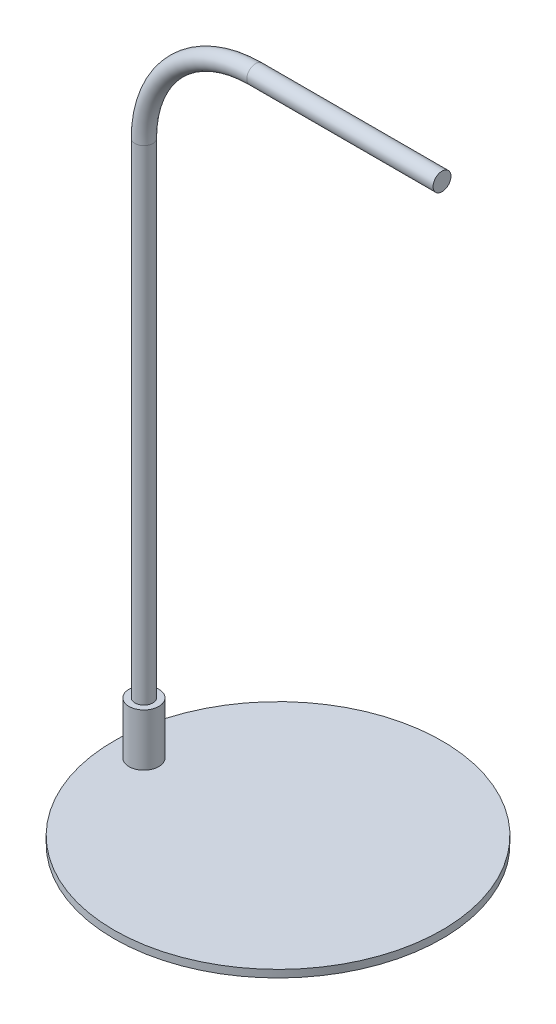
ISO-10303-21;
HEADER;
FILE_DESCRIPTION(('STEP AP214'),'2;1');
FILE_NAME('part.step','',(''),(''),'','','');
FILE_SCHEMA(('AUTOMOTIVE_DESIGN { 1 0 10303 214 1 1 1 1 }'));
ENDSEC;
DATA;
#1=APPLICATION_CONTEXT('core data for automotive mechanical design processes');
#2=APPLICATION_PROTOCOL_DEFINITION('international standard','automotive_design',2000,#1);
#3=PRODUCT_CONTEXT('',#1,'mechanical');
#4=PRODUCT('Part','Part','',(#3));
#5=PRODUCT_RELATED_PRODUCT_CATEGORY('part','',(#4));
#6=PRODUCT_DEFINITION_FORMATION('','',#4);
#7=PRODUCT_DEFINITION_CONTEXT('part definition',#1,'design');
#8=PRODUCT_DEFINITION('design','',#6,#7);
#9=PRODUCT_DEFINITION_SHAPE('','',#8);
#10=(LENGTH_UNIT() NAMED_UNIT(*) SI_UNIT(.MILLI.,.METRE.));
#11=(NAMED_UNIT(*) PLANE_ANGLE_UNIT() SI_UNIT($,.RADIAN.));
#12=(NAMED_UNIT(*) SI_UNIT($,.STERADIAN.) SOLID_ANGLE_UNIT());
#13=UNCERTAINTY_MEASURE_WITH_UNIT(LENGTH_MEASURE(1.E-05),#10,'distance_accuracy_value','');
#14=(GEOMETRIC_REPRESENTATION_CONTEXT(3) GLOBAL_UNCERTAINTY_ASSIGNED_CONTEXT((#13)) GLOBAL_UNIT_ASSIGNED_CONTEXT((#10,
#11,#12)) REPRESENTATION_CONTEXT('',''));
#15=CARTESIAN_POINT('',(0.,0.,0.));
#16=DIRECTION('',(0.,0.,1.));
#17=DIRECTION('',(1.,0.,0.));
#18=AXIS2_PLACEMENT_3D('',#15,#16,#17);
#19=CARTESIAN_POINT('',(-90.,40.,0.));
#20=DIRECTION('',(0.,-1.,0.));
#21=DIRECTION('',(0.,0.,1.));
#22=AXIS2_PLACEMENT_3D('',#19,#20,#21);
#23=PLANE('',#22);
#24=CARTESIAN_POINT('',(-90.,40.,0.));
#25=DIRECTION('',(0.,-1.,0.));
#26=DIRECTION('',(0.,0.,1.));
#27=AXIS2_PLACEMENT_3D('',#24,#25,#26);
#28=CIRCLE('',#27,6.);
#29=CARTESIAN_POINT('',(-90.,40.,6.));
#30=VERTEX_POINT('',#29);
#31=EDGE_CURVE('E66',#30,#30,#28,.T.);
#32=ORIENTED_EDGE('',*,*,#31,.T.);
#33=EDGE_LOOP('',(#32));
#34=FACE_BOUND('',#33,.T.);
#35=ADVANCED_FACE('F54',(#34),#23,.T.);
#36=CARTESIAN_POINT('',(110.,440.,0.));
#37=DIRECTION('',(-1.,0.,0.));
#38=DIRECTION('',(0.,0.,1.));
#39=AXIS2_PLACEMENT_3D('',#36,#37,#38);
#40=PLANE('',#39);
#41=CARTESIAN_POINT('',(110.,440.,0.));
#42=DIRECTION('',(-1.,0.,0.));
#43=DIRECTION('',(0.,0.,1.));
#44=AXIS2_PLACEMENT_3D('',#41,#42,#43);
#45=CIRCLE('',#44,6.);
#46=CARTESIAN_POINT('',(110.,440.,6.));
#47=VERTEX_POINT('',#46);
#48=EDGE_CURVE('E13',#47,#47,#45,.T.);
#49=ORIENTED_EDGE('',*,*,#48,.F.);
#50=EDGE_LOOP('',(#49));
#51=FACE_BOUND('',#50,.T.);
#52=ADVANCED_FACE('F72',(#51),#40,.F.);
#53=CARTESIAN_POINT('',(-90.,40.,0.));
#54=DIRECTION('',(0.,1.,0.));
#55=DIRECTION('',(0.,0.,1.));
#56=AXIS2_PLACEMENT_3D('',#53,#54,#55);
#57=CYLINDRICAL_SURFACE('',#56,6.);
#58=CARTESIAN_POINT('',(-90.,365.,0.));
#59=DIRECTION('',(0.,-1.,0.));
#60=DIRECTION('',(0.,0.,1.));
#61=AXIS2_PLACEMENT_3D('',#58,#59,#60);
#62=CIRCLE('',#61,6.);
#63=CARTESIAN_POINT('',(-96.,365.,0.));
#64=VERTEX_POINT('',#63);
#65=EDGE_CURVE('E97',#64,#64,#62,.T.);
#66=ORIENTED_EDGE('',*,*,#65,.T.);
#67=EDGE_LOOP('',(#66));
#68=FACE_BOUND('',#67,.T.);
#69=ORIENTED_EDGE('',*,*,#31,.F.);
#70=EDGE_LOOP('',(#69));
#71=FACE_BOUND('',#70,.T.);
#72=ADVANCED_FACE('F74',(#68,#71),#57,.T.);
#73=CARTESIAN_POINT('',(-15.,365.,0.));
#74=DIRECTION('',(0.,0.,-1.));
#75=DIRECTION('',(-1.,0.,0.));
#76=AXIS2_PLACEMENT_3D('',#73,#74,#75);
#77=TOROIDAL_SURFACE('',#76,75.,6.);
#78=CARTESIAN_POINT('',(-15.,440.,0.));
#79=DIRECTION('',(-1.,0.,0.));
#80=DIRECTION('',(0.,0.,1.));
#81=AXIS2_PLACEMENT_3D('',#78,#79,#80);
#82=CIRCLE('',#81,6.);
#83=CARTESIAN_POINT('',(-15.,446.,0.));
#84=VERTEX_POINT('',#83);
#85=EDGE_CURVE('E61',#84,#84,#82,.T.);
#86=CARTESIAN_POINT('',(-15.,365.,0.));
#87=DIRECTION('',(0.,0.,-1.));
#88=DIRECTION('',(-1.,0.,0.));
#89=AXIS2_PLACEMENT_3D('',#86,#87,#88);
#90=CIRCLE('',#89,81.);
#91=EDGE_CURVE('',#64,#84,#90,.T.);
#92=ORIENTED_EDGE('',*,*,#65,.F.);
#93=ORIENTED_EDGE('',*,*,#85,.T.);
#94=ORIENTED_EDGE('',*,*,#91,.T.);
#95=ORIENTED_EDGE('',*,*,#91,.F.);
#96=EDGE_LOOP('',(#92,#94,#93,#95));
#97=FACE_BOUND('',#96,.T.);
#98=ADVANCED_FACE('F79',(#97),#77,.T.);
#99=CARTESIAN_POINT('',(-15.,440.,0.));
#100=DIRECTION('',(1.,0.,0.));
#101=DIRECTION('',(0.,0.,-1.));
#102=AXIS2_PLACEMENT_3D('',#99,#100,#101);
#103=CYLINDRICAL_SURFACE('',#102,6.);
#104=ORIENTED_EDGE('',*,*,#48,.T.);
#105=EDGE_LOOP('',(#104));
#106=FACE_BOUND('',#105,.T.);
#107=ORIENTED_EDGE('',*,*,#85,.F.);
#108=EDGE_LOOP('',(#107));
#109=FACE_BOUND('',#108,.T.);
#110=ADVANCED_FACE('F69',(#106,#109),#103,.T.);
#111=CLOSED_SHELL('',(#35,#52,#72,#98,#110));
#112=MANIFOLD_SOLID_BREP('B2',#111);
#113=CARTESIAN_POINT('',(-90.,40.,0.));
#114=DIRECTION('',(0.,-1.,0.));
#115=DIRECTION('',(0.,0.,-1.));
#116=AXIS2_PLACEMENT_3D('',#113,#114,#115);
#117=CYLINDRICAL_SURFACE('',#116,9.99999999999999);
#118=CARTESIAN_POINT('',(-90.,40.,0.));
#119=DIRECTION('',(0.,1.,0.));
#120=DIRECTION('',(0.,0.,1.));
#121=AXIS2_PLACEMENT_3D('',#118,#119,#120);
#122=CIRCLE('',#121,9.99999999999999);
#123=CARTESIAN_POINT('',(-90.,40.,9.99999999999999));
#124=VERTEX_POINT('',#123);
#125=EDGE_CURVE('E53',#124,#124,#122,.T.);
#126=ORIENTED_EDGE('',*,*,#125,.F.);
#127=EDGE_LOOP('',(#126));
#128=FACE_BOUND('',#127,.T.);
#129=CARTESIAN_POINT('',(-90.,5.,0.));
#130=DIRECTION('',(0.,1.,0.));
#131=DIRECTION('',(0.,0.,1.));
#132=AXIS2_PLACEMENT_3D('',#129,#130,#131);
#133=CIRCLE('',#132,9.99999999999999);
#134=CARTESIAN_POINT('',(-90.,5.,9.99999999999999));
#135=VERTEX_POINT('',#134);
#136=EDGE_CURVE('E137',#135,#135,#133,.T.);
#137=ORIENTED_EDGE('',*,*,#136,.T.);
#138=EDGE_LOOP('',(#137));
#139=FACE_BOUND('',#138,.T.);
#140=ADVANCED_FACE('F134',(#128,#139),#117,.T.);
#141=CARTESIAN_POINT('',(-90.,40.,0.));
#142=DIRECTION('',(0.,1.,0.));
#143=DIRECTION('',(0.,0.,1.));
#144=AXIS2_PLACEMENT_3D('',#141,#142,#143);
#145=PLANE('',#144);
#146=ORIENTED_EDGE('',*,*,#125,.T.);
#147=EDGE_LOOP('',(#146));
#148=FACE_BOUND('',#147,.T.);
#149=ADVANCED_FACE('F149',(#148),#145,.T.);
#150=CARTESIAN_POINT('',(-90.,5.,0.));
#151=DIRECTION('',(0.,1.,0.));
#152=DIRECTION('',(0.,0.,1.));
#153=AXIS2_PLACEMENT_3D('',#150,#151,#152);
#154=PLANE('',#153);
#155=ORIENTED_EDGE('',*,*,#136,.F.);
#156=EDGE_LOOP('',(#155));
#157=FACE_BOUND('',#156,.T.);
#158=ADVANCED_FACE('F147',(#157),#154,.F.);
#159=CLOSED_SHELL('',(#140,#149,#158));
#160=MANIFOLD_SOLID_BREP('B7',#159);
#161=CARTESIAN_POINT('',(0.,5.,0.));
#162=DIRECTION('',(0.,-1.,0.));
#163=DIRECTION('',(0.,0.,-1.));
#164=AXIS2_PLACEMENT_3D('',#161,#162,#163);
#165=CYLINDRICAL_SURFACE('',#164,110.);
#166=CARTESIAN_POINT('',(0.,5.,0.));
#167=DIRECTION('',(0.,1.,0.));
#168=DIRECTION('',(0.,0.,1.));
#169=AXIS2_PLACEMENT_3D('',#166,#167,#168);
#170=CIRCLE('',#169,110.);
#171=CARTESIAN_POINT('',(0.,5.,110.));
#172=VERTEX_POINT('',#171);
#173=EDGE_CURVE('E133',#172,#172,#170,.T.);
#174=ORIENTED_EDGE('',*,*,#173,.F.);
#175=EDGE_LOOP('',(#174));
#176=FACE_BOUND('',#175,.T.);
#177=CARTESIAN_POINT('',(0.,0.,0.));
#178=DIRECTION('',(0.,1.,0.));
#179=DIRECTION('',(0.,0.,1.));
#180=AXIS2_PLACEMENT_3D('',#177,#178,#179);
#181=CIRCLE('',#180,110.);
#182=CARTESIAN_POINT('',(0.,0.,110.));
#183=VERTEX_POINT('',#182);
#184=EDGE_CURVE('E178',#183,#183,#181,.T.);
#185=ORIENTED_EDGE('',*,*,#184,.T.);
#186=EDGE_LOOP('',(#185));
#187=FACE_BOUND('',#186,.T.);
#188=ADVANCED_FACE('F175',(#176,#187),#165,.T.);
#189=CARTESIAN_POINT('',(0.,5.,0.));
#190=DIRECTION('',(0.,1.,0.));
#191=DIRECTION('',(0.,0.,1.));
#192=AXIS2_PLACEMENT_3D('',#189,#190,#191);
#193=PLANE('',#192);
#194=ORIENTED_EDGE('',*,*,#173,.T.);
#195=EDGE_LOOP('',(#194));
#196=FACE_BOUND('',#195,.T.);
#197=ADVANCED_FACE('F190',(#196),#193,.T.);
#198=CARTESIAN_POINT('',(0.,0.,0.));
#199=DIRECTION('',(0.,1.,0.));
#200=DIRECTION('',(0.,0.,1.));
#201=AXIS2_PLACEMENT_3D('',#198,#199,#200);
#202=PLANE('',#201);
#203=ORIENTED_EDGE('',*,*,#184,.F.);
#204=EDGE_LOOP('',(#203));
#205=FACE_BOUND('',#204,.T.);
#206=ADVANCED_FACE('F188',(#205),#202,.F.);
#207=CLOSED_SHELL('',(#188,#197,#206));
#208=MANIFOLD_SOLID_BREP('B48',#207);
#209=ADVANCED_BREP_SHAPE_REPRESENTATION('',(#18,#112,#160,#208),#14);
#210=SHAPE_DEFINITION_REPRESENTATION(#9,#209);
ENDSEC;
END-ISO-10303-21;
